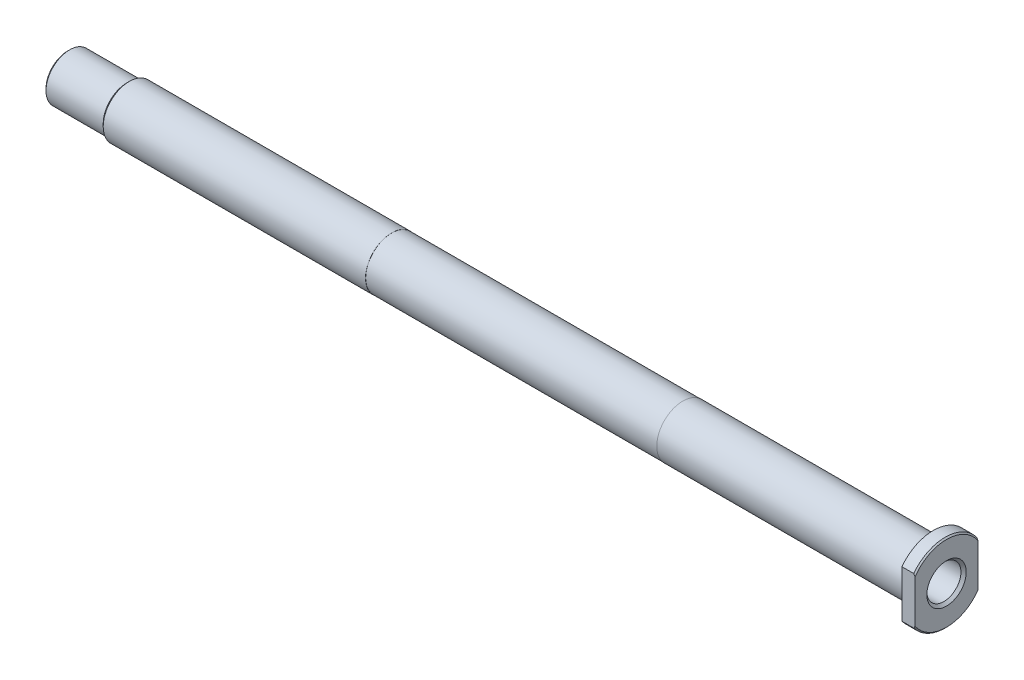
ISO-10303-21;
HEADER;
FILE_DESCRIPTION(('STEP AP214'),'2;1');
FILE_NAME('part.step','',(''),(''),'','','');
FILE_SCHEMA(('AUTOMOTIVE_DESIGN { 1 0 10303 214 1 1 1 1 }'));
ENDSEC;
DATA;
#1=APPLICATION_CONTEXT('core data for automotive mechanical design processes');
#2=APPLICATION_PROTOCOL_DEFINITION('international standard','automotive_design',2000,#1);
#3=PRODUCT_CONTEXT('',#1,'mechanical');
#4=PRODUCT('Part','Part','',(#3));
#5=PRODUCT_RELATED_PRODUCT_CATEGORY('part','',(#4));
#6=PRODUCT_DEFINITION_FORMATION('','',#4);
#7=PRODUCT_DEFINITION_CONTEXT('part definition',#1,'design');
#8=PRODUCT_DEFINITION('design','',#6,#7);
#9=PRODUCT_DEFINITION_SHAPE('','',#8);
#10=(LENGTH_UNIT() NAMED_UNIT(*) SI_UNIT(.MILLI.,.METRE.));
#11=(NAMED_UNIT(*) PLANE_ANGLE_UNIT() SI_UNIT($,.RADIAN.));
#12=(NAMED_UNIT(*) SI_UNIT($,.STERADIAN.) SOLID_ANGLE_UNIT());
#13=UNCERTAINTY_MEASURE_WITH_UNIT(LENGTH_MEASURE(1.E-05),#10,'distance_accuracy_value','');
#14=(GEOMETRIC_REPRESENTATION_CONTEXT(3) GLOBAL_UNCERTAINTY_ASSIGNED_CONTEXT((#13)) GLOBAL_UNIT_ASSIGNED_CONTEXT((#10,
#11,#12)) REPRESENTATION_CONTEXT('',''));
#15=CARTESIAN_POINT('',(0.,0.,0.));
#16=DIRECTION('',(0.,0.,1.));
#17=DIRECTION('',(1.,0.,0.));
#18=AXIS2_PLACEMENT_3D('',#15,#16,#17);
#19=CARTESIAN_POINT('',(5.00000000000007,0.,0.));
#20=DIRECTION('',(1.,0.,0.));
#21=DIRECTION('',(0.,0.,-1.));
#22=AXIS2_PLACEMENT_3D('',#19,#20,#21);
#23=CONICAL_SURFACE('',#22,7.49999999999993,0.785398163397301);
#24=CARTESIAN_POINT('',(4.,0.,0.));
#25=DIRECTION('',(1.,0.,0.));
#26=DIRECTION('',(0.,0.,1.));
#27=AXIS2_PLACEMENT_3D('',#24,#25,#26);
#28=CIRCLE('',#27,6.5);
#29=CARTESIAN_POINT('',(4.,0.,6.49999999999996));
#30=VERTEX_POINT('',#29);
#31=EDGE_CURVE('E84',#30,#30,#28,.F.);
#32=ORIENTED_EDGE('',*,*,#31,.T.);
#33=EDGE_LOOP('',(#32));
#34=FACE_BOUND('',#33,.T.);
#35=CARTESIAN_POINT('',(5.00000000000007,0.,0.));
#36=DIRECTION('',(1.,0.,0.));
#37=DIRECTION('',(0.,0.,-1.));
#38=AXIS2_PLACEMENT_3D('',#35,#36,#37);
#39=CIRCLE('',#38,7.49999999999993);
#40=CARTESIAN_POINT('',(5.00000000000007,0.,-7.49999999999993));
#41=VERTEX_POINT('',#40);
#42=EDGE_CURVE('E83',#41,#41,#39,.F.);
#43=ORIENTED_EDGE('',*,*,#42,.F.);
#44=EDGE_LOOP('',(#43));
#45=FACE_BOUND('',#44,.T.);
#46=ADVANCED_FACE('F14',(#34,#45),#23,.F.);
#47=CARTESIAN_POINT('',(-296.5,0.,0.));
#48=DIRECTION('',(1.,0.,0.));
#49=DIRECTION('',(0.,0.,-1.));
#50=AXIS2_PLACEMENT_3D('',#47,#48,#49);
#51=CYLINDRICAL_SURFACE('',#50,6.5);
#52=CARTESIAN_POINT('',(-296.500000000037,0.,0.));
#53=DIRECTION('',(1.,0.,0.));
#54=DIRECTION('',(0.,0.,1.));
#55=AXIS2_PLACEMENT_3D('',#52,#53,#54);
#56=CIRCLE('',#55,6.50000000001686);
#57=CARTESIAN_POINT('',(-296.500000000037,0.,6.50000000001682));
#58=VERTEX_POINT('',#57);
#59=EDGE_CURVE('E263',#58,#58,#56,.F.);
#60=ORIENTED_EDGE('',*,*,#59,.T.);
#61=EDGE_LOOP('',(#60));
#62=FACE_BOUND('',#61,.T.);
#63=ORIENTED_EDGE('',*,*,#31,.F.);
#64=EDGE_LOOP('',(#63));
#65=FACE_BOUND('',#64,.T.);
#66=ADVANCED_FACE('F127',(#62,#65),#51,.F.);
#67=CARTESIAN_POINT('',(4.49999999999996,0.,0.));
#68=DIRECTION('',(-1.,0.,0.));
#69=DIRECTION('',(0.,0.,1.));
#70=AXIS2_PLACEMENT_3D('',#67,#68,#69);
#71=CONICAL_SURFACE('',#70,15.,0.7853981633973);
#72=CARTESIAN_POINT('',(4.99999999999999,0.,0.));
#73=DIRECTION('',(-1.,0.,0.));
#74=DIRECTION('',(0.,0.,1.));
#75=AXIS2_PLACEMENT_3D('',#72,#73,#74);
#76=CIRCLE('',#75,14.5000000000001);
#77=CARTESIAN_POINT('',(5.,-8.13941029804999,12.));
#78=VERTEX_POINT('',#77);
#79=CARTESIAN_POINT('',(4.99999999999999,-8.13941029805,-12.));
#80=VERTEX_POINT('',#79);
#81=EDGE_CURVE('E73',#78,#80,#76,.F.);
#82=ORIENTED_EDGE('',*,*,#81,.F.);
#83=CARTESIAN_POINT('',(4.99999999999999,-8.13941029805,12.));
#84=CARTESIAN_POINT('',(4.95939816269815,-8.21174034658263,12.));
#85=CARTESIAN_POINT('',(4.91851484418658,-8.2839121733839,12.));
#86=CARTESIAN_POINT('',(4.83621006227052,-8.4279433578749,12.));
#87=CARTESIAN_POINT('',(4.79478862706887,-8.49980273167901,12.));
#88=CARTESIAN_POINT('',(4.71142830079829,-8.64322033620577,12.));
#89=CARTESIAN_POINT('',(4.66948941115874,-8.71477856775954,12.));
#90=CARTESIAN_POINT('',(4.58511294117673,-8.85760548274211,12.));
#91=CARTESIAN_POINT('',(4.54267533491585,-8.92887415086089,12.));
#92=CARTESIAN_POINT('',(4.49999999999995,-8.99999999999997,12.));
#93=B_SPLINE_CURVE_WITH_KNOTS('',3,(#83,#84,#85,#86,#87,#88,#89,#90,#91,#92),.UNSPECIFIED.,.F.,
.F.,(4,2,2,2,4),(0.,0.248839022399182,0.497665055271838,0.746490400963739,0.995328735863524),.UNSPECIFIED.);
#94=CARTESIAN_POINT('',(4.49999999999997,-8.99999999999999,12.));
#95=VERTEX_POINT('',#94);
#96=EDGE_CURVE('E77',#78,#95,#93,.T.);
#97=ORIENTED_EDGE('',*,*,#96,.T.);
#98=CARTESIAN_POINT('',(4.5,0.,0.));
#99=DIRECTION('',(1.,0.,0.));
#100=DIRECTION('',(0.,0.,-1.));
#101=AXIS2_PLACEMENT_3D('',#98,#99,#100);
#102=CIRCLE('',#101,15.);
#103=CARTESIAN_POINT('',(4.49999999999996,-9.,-12.));
#104=VERTEX_POINT('',#103);
#105=EDGE_CURVE('E100',#104,#95,#102,.F.);
#106=ORIENTED_EDGE('',*,*,#105,.F.);
#107=CARTESIAN_POINT('',(4.49999999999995,-8.99999999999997,-12.));
#108=CARTESIAN_POINT('',(4.54267533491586,-8.92887415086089,-12.));
#109=CARTESIAN_POINT('',(4.58511294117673,-8.85760548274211,-12.));
#110=CARTESIAN_POINT('',(4.66948941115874,-8.71477856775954,-12.));
#111=CARTESIAN_POINT('',(4.7114283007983,-8.64322033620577,-12.));
#112=CARTESIAN_POINT('',(4.79478862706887,-8.49980273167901,-12.));
#113=CARTESIAN_POINT('',(4.83621006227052,-8.42794335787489,-12.));
#114=CARTESIAN_POINT('',(4.91851484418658,-8.2839121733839,-12.));
#115=CARTESIAN_POINT('',(4.95939816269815,-8.21174034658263,-12.));
#116=CARTESIAN_POINT('',(5.,-8.13941029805,-12.));
#117=B_SPLINE_CURVE_WITH_KNOTS('',3,(#107,#108,#109,#110,#111,#112,#113,#114,#115,#116),
.UNSPECIFIED.,.F.,.F.,(4,2,2,2,4),(0.,0.248838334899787,0.497663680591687,0.746489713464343,
0.995328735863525),.UNSPECIFIED.);
#118=EDGE_CURVE('E80',#104,#80,#117,.T.);
#119=ORIENTED_EDGE('',*,*,#118,.T.);
#120=EDGE_LOOP('',(#82,#97,#106,#119));
#121=FACE_BOUND('',#120,.T.);
#122=ADVANCED_FACE('F75',(#121),#71,.T.);
#123=CARTESIAN_POINT('',(5.,0.,0.));
#124=DIRECTION('',(1.,0.,0.));
#125=DIRECTION('',(0.,0.,-1.));
#126=AXIS2_PLACEMENT_3D('',#123,#124,#125);
#127=PLANE('',#126);
#128=ORIENTED_EDGE('',*,*,#42,.T.);
#129=EDGE_LOOP('',(#128));
#130=FACE_BOUND('',#129,.T.);
#131=CARTESIAN_POINT('',(4.99999999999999,0.,0.));
#132=DIRECTION('',(-1.,0.,0.));
#133=DIRECTION('',(0.,0.,1.));
#134=AXIS2_PLACEMENT_3D('',#131,#132,#133);
#135=CIRCLE('',#134,14.5000000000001);
#136=CARTESIAN_POINT('',(4.99999999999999,8.13941029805,12.));
#137=VERTEX_POINT('',#136);
#138=CARTESIAN_POINT('',(5.,8.13941029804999,-12.));
#139=VERTEX_POINT('',#138);
#140=EDGE_CURVE('E90',#137,#139,#135,.T.);
#141=ORIENTED_EDGE('',*,*,#140,.F.);
#142=DIRECTION('',(0.,1.,0.));
#143=VECTOR('',#142,1.);
#144=CARTESIAN_POINT('',(5.,-13.89154183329,12.));
#145=LINE('',#144,#143);
#146=EDGE_CURVE('E87',#137,#78,#145,.F.);
#147=ORIENTED_EDGE('',*,*,#146,.T.);
#148=ORIENTED_EDGE('',*,*,#81,.T.);
#149=DIRECTION('',(0.,1.,0.));
#150=VECTOR('',#149,1.);
#151=CARTESIAN_POINT('',(5.,14.03023505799,-12.));
#152=LINE('',#151,#150);
#153=EDGE_CURVE('E144',#80,#139,#152,.T.);
#154=ORIENTED_EDGE('',*,*,#153,.T.);
#155=EDGE_LOOP('',(#141,#147,#148,#154));
#156=FACE_BOUND('',#155,.T.);
#157=ADVANCED_FACE('F88',(#130,#156),#127,.T.);
#158=CARTESIAN_POINT('',(4.49999999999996,0.,0.));
#159=DIRECTION('',(-1.,0.,0.));
#160=DIRECTION('',(0.,0.,1.));
#161=AXIS2_PLACEMENT_3D('',#158,#159,#160);
#162=CONICAL_SURFACE('',#161,15.,0.7853981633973);
#163=CARTESIAN_POINT('',(4.5,0.,0.));
#164=DIRECTION('',(1.,0.,0.));
#165=DIRECTION('',(0.,0.,-1.));
#166=AXIS2_PLACEMENT_3D('',#163,#164,#165);
#167=CIRCLE('',#166,15.);
#168=CARTESIAN_POINT('',(4.49999999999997,8.99999999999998,12.));
#169=VERTEX_POINT('',#168);
#170=CARTESIAN_POINT('',(4.49999999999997,8.99999999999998,-12.));
#171=VERTEX_POINT('',#170);
#172=EDGE_CURVE('E143',#169,#171,#167,.F.);
#173=ORIENTED_EDGE('',*,*,#172,.F.);
#174=CARTESIAN_POINT('',(4.49999999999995,8.99999999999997,12.));
#175=CARTESIAN_POINT('',(4.54267533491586,8.92887415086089,12.));
#176=CARTESIAN_POINT('',(4.58511294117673,8.85760548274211,12.));
#177=CARTESIAN_POINT('',(4.66948941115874,8.71477856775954,12.));
#178=CARTESIAN_POINT('',(4.7114283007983,8.64322033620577,12.));
#179=CARTESIAN_POINT('',(4.79478862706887,8.49980273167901,12.));
#180=CARTESIAN_POINT('',(4.83621006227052,8.42794335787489,12.));
#181=CARTESIAN_POINT('',(4.91851484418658,8.2839121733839,12.));
#182=CARTESIAN_POINT('',(4.95939816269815,8.21174034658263,12.));
#183=CARTESIAN_POINT('',(5.,8.13941029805,12.));
#184=B_SPLINE_CURVE_WITH_KNOTS('',3,(#174,#175,#176,#177,#178,#179,#180,#181,#182,#183),
.UNSPECIFIED.,.F.,.F.,(4,2,2,2,4),(0.,0.248838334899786,0.497663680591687,0.746489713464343,
0.995328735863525),.UNSPECIFIED.);
#185=EDGE_CURVE('E94',#169,#137,#184,.T.);
#186=ORIENTED_EDGE('',*,*,#185,.T.);
#187=ORIENTED_EDGE('',*,*,#140,.T.);
#188=CARTESIAN_POINT('',(4.99999999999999,8.13941029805,-12.));
#189=CARTESIAN_POINT('',(4.95939816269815,8.21174034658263,-12.));
#190=CARTESIAN_POINT('',(4.91851484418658,8.2839121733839,-12.));
#191=CARTESIAN_POINT('',(4.83621006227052,8.4279433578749,-12.));
#192=CARTESIAN_POINT('',(4.79478862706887,8.49980273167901,-12.));
#193=CARTESIAN_POINT('',(4.7114283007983,8.64322033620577,-12.));
#194=CARTESIAN_POINT('',(4.66948941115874,8.71477856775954,-12.));
#195=CARTESIAN_POINT('',(4.58511294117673,8.85760548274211,-12.));
#196=CARTESIAN_POINT('',(4.54267533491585,8.92887415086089,-12.));
#197=CARTESIAN_POINT('',(4.49999999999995,8.99999999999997,-12.));
#198=B_SPLINE_CURVE_WITH_KNOTS('',3,(#188,#189,#190,#191,#192,#193,#194,#195,#196,#197),
.UNSPECIFIED.,.F.,.F.,(4,2,2,2,4),(0.,0.24883902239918,0.497665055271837,0.74649040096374,
0.995328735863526),.UNSPECIFIED.);
#199=EDGE_CURVE('E138',#139,#171,#198,.T.);
#200=ORIENTED_EDGE('',*,*,#199,.T.);
#201=EDGE_LOOP('',(#173,#186,#187,#200));
#202=FACE_BOUND('',#201,.T.);
#203=ADVANCED_FACE('F131',(#202),#162,.T.);
#204=CARTESIAN_POINT('',(-296.500000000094,0.,0.));
#205=DIRECTION('',(1.,0.,0.));
#206=DIRECTION('',(0.,0.,-1.));
#207=AXIS2_PLACEMENT_3D('',#204,#205,#206);
#208=CONICAL_SURFACE('',#207,6.49999999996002,1.04719755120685);
#209=ORIENTED_EDGE('',*,*,#59,.F.);
#210=EDGE_LOOP('',(#209));
#211=FACE_BOUND('',#210,.T.);
#212=CARTESIAN_POINT('',(-297.3660254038,0.,0.));
#213=DIRECTION('',(-1.,0.,0.));
#214=DIRECTION('',(0.,-1.,0.));
#215=AXIS2_PLACEMENT_3D('',#212,#213,#214);
#216=CIRCLE('',#215,5.);
#217=CARTESIAN_POINT('',(-297.3660254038,-5.,0.));
#218=VERTEX_POINT('',#217);
#219=EDGE_CURVE('E251',#218,#218,#216,.T.);
#220=ORIENTED_EDGE('',*,*,#219,.T.);
#221=EDGE_LOOP('',(#220));
#222=FACE_BOUND('',#221,.T.);
#223=ADVANCED_FACE('F135',(#211,#222),#208,.F.);
#224=CARTESIAN_POINT('',(5.,-13.89154183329,12.));
#225=DIRECTION('',(0.,0.,-1.));
#226=DIRECTION('',(-1.,0.,0.));
#227=AXIS2_PLACEMENT_3D('',#224,#225,#226);
#228=PLANE('',#227);
#229=DIRECTION('',(1.,0.,0.));
#230=VECTOR('',#229,1.);
#231=CARTESIAN_POINT('',(0.,-9.,12.));
#232=LINE('',#231,#230);
#233=CARTESIAN_POINT('',(0.,-9.,12.));
#234=VERTEX_POINT('',#233);
#235=EDGE_CURVE('E98',#95,#234,#232,.F.);
#236=ORIENTED_EDGE('',*,*,#235,.F.);
#237=ORIENTED_EDGE('',*,*,#96,.F.);
#238=ORIENTED_EDGE('',*,*,#146,.F.);
#239=ORIENTED_EDGE('',*,*,#185,.F.);
#240=DIRECTION('',(1.,0.,0.));
#241=VECTOR('',#240,1.);
#242=CARTESIAN_POINT('',(0.,9.,12.));
#243=LINE('',#242,#241);
#244=CARTESIAN_POINT('',(0.,9.,12.));
#245=VERTEX_POINT('',#244);
#246=EDGE_CURVE('E253',#245,#169,#243,.T.);
#247=ORIENTED_EDGE('',*,*,#246,.F.);
#248=DIRECTION('',(0.,1.,0.));
#249=VECTOR('',#248,1.);
#250=CARTESIAN_POINT('',(0.,0.,12.));
#251=LINE('',#250,#249);
#252=EDGE_CURVE('E213',#245,#234,#251,.F.);
#253=ORIENTED_EDGE('',*,*,#252,.T.);
#254=EDGE_LOOP('',(#236,#237,#238,#239,#247,#253));
#255=FACE_BOUND('',#254,.T.);
#256=ADVANCED_FACE('F96',(#255),#228,.F.);
#257=CARTESIAN_POINT('',(0.,0.,0.));
#258=DIRECTION('',(1.,0.,0.));
#259=DIRECTION('',(0.,0.,-1.));
#260=AXIS2_PLACEMENT_3D('',#257,#258,#259);
#261=CYLINDRICAL_SURFACE('',#260,15.);
#262=ORIENTED_EDGE('',*,*,#105,.T.);
#263=ORIENTED_EDGE('',*,*,#235,.T.);
#264=CARTESIAN_POINT('',(0.,0.,0.));
#265=DIRECTION('',(1.,0.,0.));
#266=DIRECTION('',(0.,0.,-1.));
#267=AXIS2_PLACEMENT_3D('',#264,#265,#266);
#268=CIRCLE('',#267,15.);
#269=CARTESIAN_POINT('',(0.,-9.,-12.));
#270=VERTEX_POINT('',#269);
#271=EDGE_CURVE('E145',#234,#270,#268,.T.);
#272=ORIENTED_EDGE('',*,*,#271,.T.);
#273=DIRECTION('',(1.,0.,0.));
#274=VECTOR('',#273,1.);
#275=CARTESIAN_POINT('',(5.,-9.,-12.));
#276=LINE('',#275,#274);
#277=EDGE_CURVE('E497',#270,#104,#276,.T.);
#278=ORIENTED_EDGE('',*,*,#277,.T.);
#279=EDGE_LOOP('',(#262,#263,#272,#278));
#280=FACE_BOUND('',#279,.T.);
#281=ADVANCED_FACE('F152',(#280),#261,.T.);
#282=CARTESIAN_POINT('',(5.,14.03023505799,-12.));
#283=DIRECTION('',(0.,0.,1.));
#284=DIRECTION('',(1.,0.,0.));
#285=AXIS2_PLACEMENT_3D('',#282,#283,#284);
#286=PLANE('',#285);
#287=DIRECTION('',(1.,0.,0.));
#288=VECTOR('',#287,1.);
#289=CARTESIAN_POINT('',(0.,9.,-12.));
#290=LINE('',#289,#288);
#291=CARTESIAN_POINT('',(0.,9.,-12.));
#292=VERTEX_POINT('',#291);
#293=EDGE_CURVE('E257',#171,#292,#290,.F.);
#294=ORIENTED_EDGE('',*,*,#293,.F.);
#295=ORIENTED_EDGE('',*,*,#199,.F.);
#296=ORIENTED_EDGE('',*,*,#153,.F.);
#297=ORIENTED_EDGE('',*,*,#118,.F.);
#298=ORIENTED_EDGE('',*,*,#277,.F.);
#299=DIRECTION('',(0.,1.,0.));
#300=VECTOR('',#299,1.);
#301=CARTESIAN_POINT('',(0.,0.,-12.));
#302=LINE('',#301,#300);
#303=EDGE_CURVE('E239',#270,#292,#302,.T.);
#304=ORIENTED_EDGE('',*,*,#303,.T.);
#305=EDGE_LOOP('',(#294,#295,#296,#297,#298,#304));
#306=FACE_BOUND('',#305,.T.);
#307=ADVANCED_FACE('F147',(#306),#286,.F.);
#308=CARTESIAN_POINT('',(0.,0.,0.));
#309=DIRECTION('',(1.,0.,0.));
#310=DIRECTION('',(0.,0.,-1.));
#311=AXIS2_PLACEMENT_3D('',#308,#309,#310);
#312=CYLINDRICAL_SURFACE('',#311,15.);
#313=CARTESIAN_POINT('',(0.,0.,0.));
#314=DIRECTION('',(1.,0.,0.));
#315=DIRECTION('',(0.,0.,-1.));
#316=AXIS2_PLACEMENT_3D('',#313,#314,#315);
#317=CIRCLE('',#316,15.);
#318=EDGE_CURVE('E237',#292,#245,#317,.T.);
#319=ORIENTED_EDGE('',*,*,#318,.T.);
#320=ORIENTED_EDGE('',*,*,#246,.T.);
#321=ORIENTED_EDGE('',*,*,#172,.T.);
#322=ORIENTED_EDGE('',*,*,#293,.T.);
#323=EDGE_LOOP('',(#319,#320,#321,#322));
#324=FACE_BOUND('',#323,.T.);
#325=ADVANCED_FACE('F151',(#324),#312,.T.);
#326=CARTESIAN_POINT('',(-297.3660254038,0.,0.));
#327=DIRECTION('',(-1.,0.,0.));
#328=DIRECTION('',(0.,0.,1.));
#329=AXIS2_PLACEMENT_3D('',#326,#327,#328);
#330=CYLINDRICAL_SURFACE('',#329,5.);
#331=CARTESIAN_POINT('',(-329.499999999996,0.,0.));
#332=DIRECTION('',(-1.,0.,0.));
#333=DIRECTION('',(0.,-1.,0.));
#334=AXIS2_PLACEMENT_3D('',#331,#332,#333);
#335=CIRCLE('',#334,4.99999999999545);
#336=CARTESIAN_POINT('',(-329.499999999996,-4.99999999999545,0.));
#337=VERTEX_POINT('',#336);
#338=EDGE_CURVE('E185',#337,#337,#335,.T.);
#339=ORIENTED_EDGE('',*,*,#338,.T.);
#340=EDGE_LOOP('',(#339));
#341=FACE_BOUND('',#340,.T.);
#342=ORIENTED_EDGE('',*,*,#219,.F.);
#343=EDGE_LOOP('',(#342));
#344=FACE_BOUND('',#343,.T.);
#345=ADVANCED_FACE('F157',(#341,#344),#330,.F.);
#346=CARTESIAN_POINT('',(0.,0.,0.));
#347=DIRECTION('',(1.,0.,0.));
#348=DIRECTION('',(0.,0.,-1.));
#349=AXIS2_PLACEMENT_3D('',#346,#347,#348);
#350=PLANE('',#349);
#351=CARTESIAN_POINT('',(-1.72936589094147E-10,0.,0.));
#352=DIRECTION('',(-1.,0.,0.));
#353=DIRECTION('',(0.,0.,1.));
#354=AXIS2_PLACEMENT_3D('',#351,#352,#353);
#355=CIRCLE('',#354,10.24998981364);
#356=CARTESIAN_POINT('',(-1.03761920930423E-10,0.,-10.24998981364));
#357=VERTEX_POINT('',#356);
#358=CARTESIAN_POINT('',(-1.03761920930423E-10,0.,10.24998981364));
#359=VERTEX_POINT('',#358);
#360=EDGE_CURVE('E34',#357,#359,#355,.F.);
#361=ORIENTED_EDGE('',*,*,#360,.T.);
#362=CARTESIAN_POINT('',(-1.72936589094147E-10,0.,0.));
#363=DIRECTION('',(-1.,0.,0.));
#364=DIRECTION('',(0.,0.,-1.));
#365=AXIS2_PLACEMENT_3D('',#362,#363,#364);
#366=CIRCLE('',#365,10.24998981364);
#367=EDGE_CURVE('E182',#359,#357,#366,.F.);
#368=ORIENTED_EDGE('',*,*,#367,.T.);
#369=EDGE_LOOP('',(#361,#368));
#370=FACE_BOUND('',#369,.T.);
#371=ORIENTED_EDGE('',*,*,#303,.F.);
#372=ORIENTED_EDGE('',*,*,#271,.F.);
#373=ORIENTED_EDGE('',*,*,#252,.F.);
#374=ORIENTED_EDGE('',*,*,#318,.F.);
#375=EDGE_LOOP('',(#371,#372,#373,#374));
#376=FACE_BOUND('',#375,.T.);
#377=ADVANCED_FACE('F161',(#370,#376),#350,.F.);
#378=CARTESIAN_POINT('',(-329.999999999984,0.,0.));
#379=DIRECTION('',(-1.,0.,0.));
#380=DIRECTION('',(0.,0.,1.));
#381=AXIS2_PLACEMENT_3D('',#378,#379,#380);
#382=CONICAL_SURFACE('',#381,5.49999999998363,0.785398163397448);
#383=ORIENTED_EDGE('',*,*,#338,.F.);
#384=EDGE_LOOP('',(#383));
#385=FACE_BOUND('',#384,.T.);
#386=CARTESIAN_POINT('',(-329.999999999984,0.,0.));
#387=DIRECTION('',(-1.,0.,0.));
#388=DIRECTION('',(0.,0.,1.));
#389=AXIS2_PLACEMENT_3D('',#386,#387,#388);
#390=CIRCLE('',#389,5.49999999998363);
#391=CARTESIAN_POINT('',(-329.999999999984,0.,5.49999999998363));
#392=VERTEX_POINT('',#391);
#393=EDGE_CURVE('E188',#392,#392,#390,.F.);
#394=ORIENTED_EDGE('',*,*,#393,.F.);
#395=EDGE_LOOP('',(#394));
#396=FACE_BOUND('',#395,.T.);
#397=ADVANCED_FACE('F166',(#385,#396),#382,.F.);
#398=CARTESIAN_POINT('',(-0.3,0.,0.));
#399=DIRECTION('',(-1.,0.,0.));
#400=DIRECTION('',(0.,-0.0521597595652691,0.998638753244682));
#401=AXIS2_PLACEMENT_3D('',#398,#399,#400);
#402=TOROIDAL_SURFACE('',#401,10.25,0.3);
#403=CARTESIAN_POINT('',(-0.3,0.,0.));
#404=DIRECTION('',(-1.,0.,0.));
#405=DIRECTION('',(0.,0.,1.));
#406=AXIS2_PLACEMENT_3D('',#403,#404,#405);
#407=CIRCLE('',#406,9.95);
#408=CARTESIAN_POINT('',(-0.3,0.,9.95));
#409=VERTEX_POINT('',#408);
#410=EDGE_CURVE('E191',#409,#409,#407,.T.);
#411=ORIENTED_EDGE('',*,*,#410,.F.);
#412=EDGE_LOOP('',(#411));
#413=FACE_BOUND('',#412,.T.);
#414=ORIENTED_EDGE('',*,*,#367,.F.);
#415=ORIENTED_EDGE('',*,*,#360,.F.);
#416=EDGE_LOOP('',(#414,#415));
#417=FACE_BOUND('',#416,.T.);
#418=ADVANCED_FACE('F187',(#413,#417),#402,.F.);
#419=CARTESIAN_POINT('',(-330.,0.,0.));
#420=DIRECTION('',(-1.,0.,0.));
#421=DIRECTION('',(0.,0.,1.));
#422=AXIS2_PLACEMENT_3D('',#419,#420,#421);
#423=PLANE('',#422);
#424=ORIENTED_EDGE('',*,*,#393,.T.);
#425=EDGE_LOOP('',(#424));
#426=FACE_BOUND('',#425,.T.);
#427=CARTESIAN_POINT('',(-330.,0.,0.));
#428=DIRECTION('',(1.,0.,0.));
#429=DIRECTION('',(0.,0.,-1.));
#430=AXIS2_PLACEMENT_3D('',#427,#428,#429);
#431=CIRCLE('',#430,8.25000000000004);
#432=CARTESIAN_POINT('',(-330.,0.,-8.25000000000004));
#433=VERTEX_POINT('',#432);
#434=EDGE_CURVE('E228',#433,#433,#431,.T.);
#435=ORIENTED_EDGE('',*,*,#434,.F.);
#436=EDGE_LOOP('',(#435));
#437=FACE_BOUND('',#436,.T.);
#438=ADVANCED_FACE('F206',(#426,#437),#423,.T.);
#439=CARTESIAN_POINT('',(-0.3,0.,0.));
#440=DIRECTION('',(-1.,0.,0.));
#441=DIRECTION('',(0.,0.,1.));
#442=AXIS2_PLACEMENT_3D('',#439,#440,#441);
#443=CYLINDRICAL_SURFACE('',#442,9.95);
#444=ORIENTED_EDGE('',*,*,#410,.T.);
#445=EDGE_LOOP('',(#444));
#446=FACE_BOUND('',#445,.T.);
#447=CARTESIAN_POINT('',(-95.5,0.,0.));
#448=DIRECTION('',(-1.,0.,0.));
#449=DIRECTION('',(0.,0.,1.));
#450=AXIS2_PLACEMENT_3D('',#447,#448,#449);
#451=CIRCLE('',#450,9.95);
#452=CARTESIAN_POINT('',(-95.5,0.,9.95));
#453=VERTEX_POINT('',#452);
#454=EDGE_CURVE('E222',#453,#453,#451,.T.);
#455=ORIENTED_EDGE('',*,*,#454,.F.);
#456=EDGE_LOOP('',(#455));
#457=FACE_BOUND('',#456,.T.);
#458=ADVANCED_FACE('F303',(#446,#457),#443,.T.);
#459=CARTESIAN_POINT('',(-329.25,0.,0.));
#460=DIRECTION('',(1.,0.,0.));
#461=DIRECTION('',(0.,0.,-1.));
#462=AXIS2_PLACEMENT_3D('',#459,#460,#461);
#463=CONICAL_SURFACE('',#462,8.99999999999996,0.7853981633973);
#464=CARTESIAN_POINT('',(-329.25,0.,0.));
#465=DIRECTION('',(-1.,0.,0.));
#466=DIRECTION('',(0.,1.,0.));
#467=AXIS2_PLACEMENT_3D('',#464,#465,#466);
#468=CIRCLE('',#467,9.);
#469=CARTESIAN_POINT('',(-329.25,9.,0.));
#470=VERTEX_POINT('',#469);
#471=EDGE_CURVE('E220',#470,#470,#468,.F.);
#472=ORIENTED_EDGE('',*,*,#471,.F.);
#473=EDGE_LOOP('',(#472));
#474=FACE_BOUND('',#473,.T.);
#475=ORIENTED_EDGE('',*,*,#434,.T.);
#476=EDGE_LOOP('',(#475));
#477=FACE_BOUND('',#476,.T.);
#478=ADVANCED_FACE('F300',(#474,#477),#463,.T.);
#479=CARTESIAN_POINT('',(-95.5,0.,0.));
#480=DIRECTION('',(-1.,0.,0.));
#481=DIRECTION('',(0.,0.,1.));
#482=AXIS2_PLACEMENT_3D('',#479,#480,#481);
#483=PLANE('',#482);
#484=CARTESIAN_POINT('',(-95.5,0.,0.));
#485=DIRECTION('',(-1.,0.,0.));
#486=DIRECTION('',(0.,0.,1.));
#487=AXIS2_PLACEMENT_3D('',#484,#485,#486);
#488=CIRCLE('',#487,9.9);
#489=CARTESIAN_POINT('',(-95.5,0.,9.90000000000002));
#490=VERTEX_POINT('',#489);
#491=EDGE_CURVE('E219',#490,#490,#488,.T.);
#492=ORIENTED_EDGE('',*,*,#491,.F.);
#493=EDGE_LOOP('',(#492));
#494=FACE_BOUND('',#493,.T.);
#495=ORIENTED_EDGE('',*,*,#454,.T.);
#496=EDGE_LOOP('',(#495));
#497=FACE_BOUND('',#496,.T.);
#498=ADVANCED_FACE('F297',(#494,#497),#483,.T.);
#499=CARTESIAN_POINT('',(-307.45,0.,0.));
#500=DIRECTION('',(-1.,0.,0.));
#501=DIRECTION('',(0.,0.,1.));
#502=AXIS2_PLACEMENT_3D('',#499,#500,#501);
#503=CYLINDRICAL_SURFACE('',#502,9.);
#504=ORIENTED_EDGE('',*,*,#471,.T.);
#505=EDGE_LOOP('',(#504));
#506=FACE_BOUND('',#505,.T.);
#507=CARTESIAN_POINT('',(-307.45,0.,0.));
#508=DIRECTION('',(1.,0.,0.));
#509=DIRECTION('',(0.,0.,1.));
#510=AXIS2_PLACEMENT_3D('',#507,#508,#509);
#511=CIRCLE('',#510,9.0000000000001);
#512=CARTESIAN_POINT('',(-307.45,0.,9.0000000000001));
#513=VERTEX_POINT('',#512);
#514=EDGE_CURVE('E217',#513,#513,#511,.T.);
#515=ORIENTED_EDGE('',*,*,#514,.F.);
#516=EDGE_LOOP('',(#515));
#517=FACE_BOUND('',#516,.T.);
#518=ADVANCED_FACE('F292',(#506,#517),#503,.T.);
#519=CARTESIAN_POINT('',(-95.5,0.,0.));
#520=DIRECTION('',(-1.,0.,0.));
#521=DIRECTION('',(0.,0.,1.));
#522=AXIS2_PLACEMENT_3D('',#519,#520,#521);
#523=CYLINDRICAL_SURFACE('',#522,9.9);
#524=CARTESIAN_POINT('',(-206.5,0.,0.));
#525=DIRECTION('',(-1.,0.,0.));
#526=DIRECTION('',(0.,0.,1.));
#527=AXIS2_PLACEMENT_3D('',#524,#525,#526);
#528=CIRCLE('',#527,9.9);
#529=CARTESIAN_POINT('',(-206.5,0.,9.90000000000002));
#530=VERTEX_POINT('',#529);
#531=EDGE_CURVE('E216',#530,#530,#528,.F.);
#532=ORIENTED_EDGE('',*,*,#531,.T.);
#533=EDGE_LOOP('',(#532));
#534=FACE_BOUND('',#533,.T.);
#535=ORIENTED_EDGE('',*,*,#491,.T.);
#536=EDGE_LOOP('',(#535));
#537=FACE_BOUND('',#536,.T.);
#538=ADVANCED_FACE('F270',(#534,#537),#523,.T.);
#539=CARTESIAN_POINT('',(-306.5,0.,0.));
#540=DIRECTION('',(1.,0.,0.));
#541=DIRECTION('',(0.,0.,-1.));
#542=AXIS2_PLACEMENT_3D('',#539,#540,#541);
#543=CONICAL_SURFACE('',#542,9.94999999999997,0.7853981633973);
#544=ORIENTED_EDGE('',*,*,#514,.T.);
#545=EDGE_LOOP('',(#544));
#546=FACE_BOUND('',#545,.T.);
#547=CARTESIAN_POINT('',(-306.5,0.,0.));
#548=DIRECTION('',(-1.,0.,0.));
#549=DIRECTION('',(0.,0.,1.));
#550=AXIS2_PLACEMENT_3D('',#547,#548,#549);
#551=CIRCLE('',#550,9.95);
#552=CARTESIAN_POINT('',(-306.5,0.,9.95));
#553=VERTEX_POINT('',#552);
#554=EDGE_CURVE('E26',#553,#553,#551,.F.);
#555=ORIENTED_EDGE('',*,*,#554,.F.);
#556=EDGE_LOOP('',(#555));
#557=FACE_BOUND('',#556,.T.);
#558=ADVANCED_FACE('F276',(#546,#557),#543,.T.);
#559=CARTESIAN_POINT('',(-206.5,0.,0.));
#560=DIRECTION('',(-1.,0.,0.));
#561=DIRECTION('',(0.,0.,1.));
#562=AXIS2_PLACEMENT_3D('',#559,#560,#561);
#563=PLANE('',#562);
#564=ORIENTED_EDGE('',*,*,#531,.F.);
#565=EDGE_LOOP('',(#564));
#566=FACE_BOUND('',#565,.T.);
#567=CARTESIAN_POINT('',(-206.5,0.,0.));
#568=DIRECTION('',(-1.,0.,0.));
#569=DIRECTION('',(0.,0.,1.));
#570=AXIS2_PLACEMENT_3D('',#567,#568,#569);
#571=CIRCLE('',#570,9.95);
#572=CARTESIAN_POINT('',(-206.5,0.,9.95));
#573=VERTEX_POINT('',#572);
#574=EDGE_CURVE('E9',#573,#573,#571,.T.);
#575=ORIENTED_EDGE('',*,*,#574,.F.);
#576=EDGE_LOOP('',(#575));
#577=FACE_BOUND('',#576,.T.);
#578=ADVANCED_FACE('F273',(#566,#577),#563,.F.);
#579=CARTESIAN_POINT('',(-206.5,0.,0.));
#580=DIRECTION('',(-1.,0.,0.));
#581=DIRECTION('',(0.,0.,1.));
#582=AXIS2_PLACEMENT_3D('',#579,#580,#581);
#583=CYLINDRICAL_SURFACE('',#582,9.95);
#584=ORIENTED_EDGE('',*,*,#554,.T.);
#585=EDGE_LOOP('',(#584));
#586=FACE_BOUND('',#585,.T.);
#587=ORIENTED_EDGE('',*,*,#574,.T.);
#588=EDGE_LOOP('',(#587));
#589=FACE_BOUND('',#588,.T.);
#590=ADVANCED_FACE('F16',(#586,#589),#583,.T.);
#591=CLOSED_SHELL('',(#46,#66,#122,#157,#203,#223,#256,#281,#307,#325,#345,#377,#397,#418,#438,
#458,#478,#498,#518,#538,#558,#578,#590));
#592=MANIFOLD_SOLID_BREP('B1',#591);
#593=ADVANCED_BREP_SHAPE_REPRESENTATION('',(#18,#592),#14);
#594=SHAPE_DEFINITION_REPRESENTATION(#9,#593);
ENDSEC;
END-ISO-10303-21;
